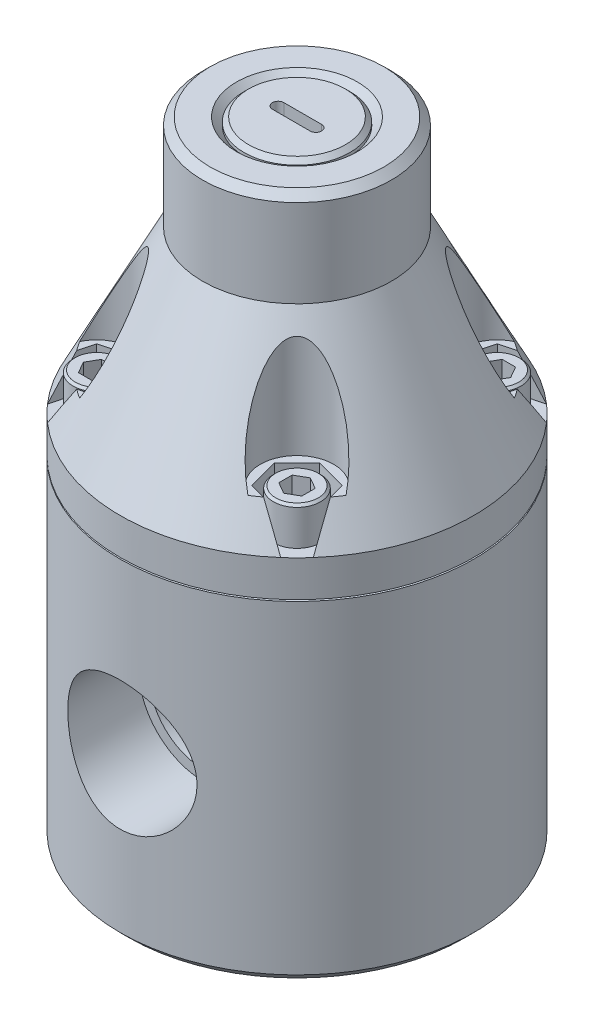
from build123d import *

# Parameters (mm, degrees)
SKETCH1_R         = 29.718
EXTRUDE1_DEPTH    = 105.41
SKETCH3_R         = 10.16
EXTRUDE2_DEPTH    = 1.27
EXTRUDE2_DRAFT    = -45
CIRPATTERN1_COUNT = 2
CHAMFER1_SIZE     = 1.27
CHAMFER2_SIZE     = 1.524
EXTRUDE3_REACH    = 115.479
SKETCH6_R         = 8.89
CHAMFER3_SIZE     = 0.762
EXTRUDE4_DEPTH    = 4.7498
SKETCH8_R         = 6.1722
EXTRUDE5_DEPTH    = 21.0058
CIRPATTERN2_COUNT = 4
EXTRUDE6_DEPTH    = 6.35
CIRPATTERN3_COUNT = 4
SKETCH10_R        = 3.9624
EXTRUDE7_DEPTH    = 6.35
EXTRUDE8_DEPTH    = 3.175
CIRPATTERN4_COUNT = 4
CHAMFER5_SIZE     = 0.381


with BuildPart() as part:
    # Sketch1 → Extrude1 (new body)
    with BuildSketch(Plane(origin=(0, 0, 0), x_dir=(1, 0, 0), z_dir=(0, 1, 0))):
        with Locations(Location((0, 0, 0), (0, 0, 270))):
            Circle(SKETCH1_R)
    extrude(amount=EXTRUDE1_DEPTH)

    # Sketch2 → Cut-Revolve1 (revolve, cut)
    with BuildSketch(Plane.XY, mode=Mode.PRIVATE) as cut_revolve1_sk:
        Polygon((-29.718, 55.88), (-20.625466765, 55.88), (-20.625466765, 56.134), (-29.718, 56.134), (-29.718, 62.23), (-15.875, 89.408), (-15.875, 105.41), (-21.125189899, 108.084162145), (-34.308703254, 108.084162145), (-34.308703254, 59.099585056), align=None)
    revolve(cut_revolve1_sk.sketch.rotate(Axis((0, 0, 0), (0, 1, 0)), 270), axis=Axis((0, 0, 0), (0, 1, 0)), mode=Mode.SUBTRACT)


with BuildPart() as extrude2_tool:
    # Sketch3 → Extrude2 (with draft: the straight prism first)
    with BuildSketch(Plane(origin=(0, 105.41, 0), x_dir=(-1, 0, 0), z_dir=(0, 1, 0))):
        Circle(SKETCH3_R)
    extrude(amount=-EXTRUDE2_DEPTH)
    # Extrude2: the draft: its side faces are tilted about the plane it starts from
    extrude2_sides = [extrude2_tool.faces().sort_by_distance(p)[0] for p in [
        (10.16, 104.775, 0),
    ]]
    draft(extrude2_sides, Plane(origin=(0, 105.41, 0), x_dir=(-1, 0, 0), z_dir=(0, 1, 0)), EXTRUDE2_DRAFT)


with BuildPart() as part_1:
    add(part.part)

    # Extrude2: cut by extrude2_tool
    add(extrude2_tool.part, mode=Mode.SUBTRACT)

    # Sketch5 → CBORE for _00 Binding Head Machine Screw (revolve, cut)
    with BuildSketch(Plane(origin=(0, 27.432, 29.718), x_dir=(0, -1, 0), z_dir=(1, 0, 0))):
        Polygon((0, 0), (0, 20.548366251), (9.1186, 16.002), (9.1186, 13.97), (10.8585, 13.97), (10.8585, 0), align=None)
    cbore_for_00_binding_head_machine_screw = revolve(axis=Axis((0, 27.432, 36.068), (0, 0, -1)), mode=Mode.SUBTRACT)

    # CirPattern1: CBORE for _00 Binding Head Machine Screw ×2 about axis
    cirpattern1_axis = Axis((0, 105.41, 0), (0, -1, 0))
    for i in range(1, CIRPATTERN1_COUNT):
        add(cbore_for_00_binding_head_machine_screw.rotate(cirpattern1_axis, i * 360 / CIRPATTERN1_COUNT), mode=Mode.SUBTRACT)

    # Chamfer1
    chamfer1_edges = [part_1.edges().sort_by_distance(p)[0] for p in [
        (0, 105.41, 15.875),
    ]]
    chamfer(chamfer1_edges, length=CHAMFER1_SIZE)

    # Chamfer2
    chamfer2_edges = [part_1.edges().sort_by_distance(p)[0] for p in [
        (0, 0, -29.718),
    ]]
    chamfer(chamfer2_edges, length=CHAMFER2_SIZE)

    # Extrude3: up to this cone (the profile starts inside it)
    extrude3_end = Plane(origin=(0, 105.41, 0), z_dir=(0, 1, 0)).offset(-10.159999) * Cone(1e-06, 136.299, 136.298999, align=(Align.CENTER, Align.CENTER, Align.MIN), mode=Mode.PRIVATE)
    # Sketch6 → Extrude3 (add, up to the surface)
    with BuildSketch(Plane(origin=(0, 105.41, 0), x_dir=(-1, 0, 0), z_dir=(0, 1, 0)), mode=Mode.PRIVATE) as extrude3_sk1:
        with Locations(Location((0, 0, 0), (0, 0, 90))):
            Circle(SKETCH6_R)
    extrude3_tool1 = extrude(extrude3_sk1.sketch, amount=-EXTRUDE3_REACH, mode=Mode.PRIVATE) & extrude3_end
    add(extrude3_tool1.solids().sort_by_distance((0, 105.41, 0))[0])

    # Chamfer3
    chamfer3_edges = [part_1.edges().sort_by_distance(p)[0] for p in [
        (0, 105.41, -8.89),
    ]]
    chamfer(chamfer3_edges, length=CHAMFER3_SIZE)

    # Sketch7 → Extrude4 (cut)
    with BuildSketch(Plane(origin=(0, 105.41, 0), x_dir=(-1, 0, 0), z_dir=(0, 1, 0))):
        with BuildLine():
            Line((-3.175, 0.9652), (3.175, 0.9652))
            ThreePointArc((3.175, 0.9652), (4.1402, 0), (3.175, -0.9652))
            Line((3.175, -0.9652), (-3.175, -0.9652))
            ThreePointArc((-3.175, -0.9652), (-4.1402, 0), (-3.175, 0.9652))
        make_face()
    extrude(amount=-EXTRUDE4_DEPTH, mode=Mode.SUBTRACT)

    # Sketch8 → Extrude5 (cut)
    with BuildSketch(Plane(origin=(0, 68.58, 0), x_dir=(-1, 0, 0), z_dir=(0, 1, 0))):
        with Locations((-16.837980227, -16.837980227)):
            Circle(SKETCH8_R)
    extrude5 = extrude(amount=EXTRUDE5_DEPTH, mode=Mode.SUBTRACT)

    # CirPattern2: Extrude5 ×4 about axis
    cirpattern2_axis = Axis((0, 0, 0), (0, 1, 0))
    for i in range(1, CIRPATTERN2_COUNT):
        add(extrude5.rotate(cirpattern2_axis, i * 360 / CIRPATTERN2_COUNT), mode=Mode.SUBTRACT)

    # Sketch9 → Extrude6 (cut)
    with BuildSketch(Plane(origin=(0, 68.58, 0), x_dir=(-1, 0, 0), z_dir=(0, 1, 0))):
        Polygon((-20.633219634, -13.04274082), (-23.297950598, -23.297950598), (-13.04274082, -20.633219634), (-11.653586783, -15.44882619), (-15.44882619, -11.653586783), align=None)
    extrude6 = extrude(amount=-EXTRUDE6_DEPTH, mode=Mode.SUBTRACT)

    # CirPattern3: Extrude6 ×4 about axis
    cirpattern3_axis = Axis((0, 0, 0), (0, 1, 0))
    for i in range(1, CIRPATTERN3_COUNT):
        add(extrude6.rotate(cirpattern3_axis, i * 360 / CIRPATTERN3_COUNT), mode=Mode.SUBTRACT)

    # Sketch10 → Extrude7 (add)
    with BuildSketch(Plane(origin=(0, 68.58, 0), x_dir=(-1, 0, 0), z_dir=(0, 1, 0))):
        with Locations(Location((-16.837980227, -16.837980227, 0), (0, 0, 90))):
            Circle(SKETCH10_R)
    extrude7 = extrude(amount=-EXTRUDE7_DEPTH)

    # Sketch11 → Extrude8 (cut)
    with BuildSketch(Plane(origin=(0, 68.58, 0), x_dir=(-1, 0, 0), z_dir=(0, 1, 0))):
        Polygon((-19.075541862, -16.837980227), (-17.956761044, -18.775765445), (-15.71919941, -18.775765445), (-14.600418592, -16.837980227), (-15.71919941, -14.900195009), (-17.956761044, -14.900195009), align=None)
    extrude8 = extrude(amount=-EXTRUDE8_DEPTH, mode=Mode.SUBTRACT)

    # CirPattern4: Extrude7, Extrude8 ×4 about axis
    cirpattern4_axis = Axis((0, 0, 0), (0, 1, 0))
    add([extrude7.rotate(cirpattern4_axis, i * 360 / CIRPATTERN4_COUNT) for i in range(1, CIRPATTERN4_COUNT)])
    add([extrude8.rotate(cirpattern4_axis, i * 360 / CIRPATTERN4_COUNT) for i in range(1, CIRPATTERN4_COUNT)], mode=Mode.SUBTRACT)

    # Chamfer5
    chamfer5_edges = [part_1.edges().sort_by_distance(p)[0] for p in [
        (16.837980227, 68.58, -20.800380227),
        (20.800380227, 68.58, 16.837980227),
        (-16.837980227, 68.58, 20.800380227),
        (-20.800380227, 68.58, -16.837980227),
    ]]
    chamfer(chamfer5_edges, length=CHAMFER5_SIZE)


solid = part_1.part
